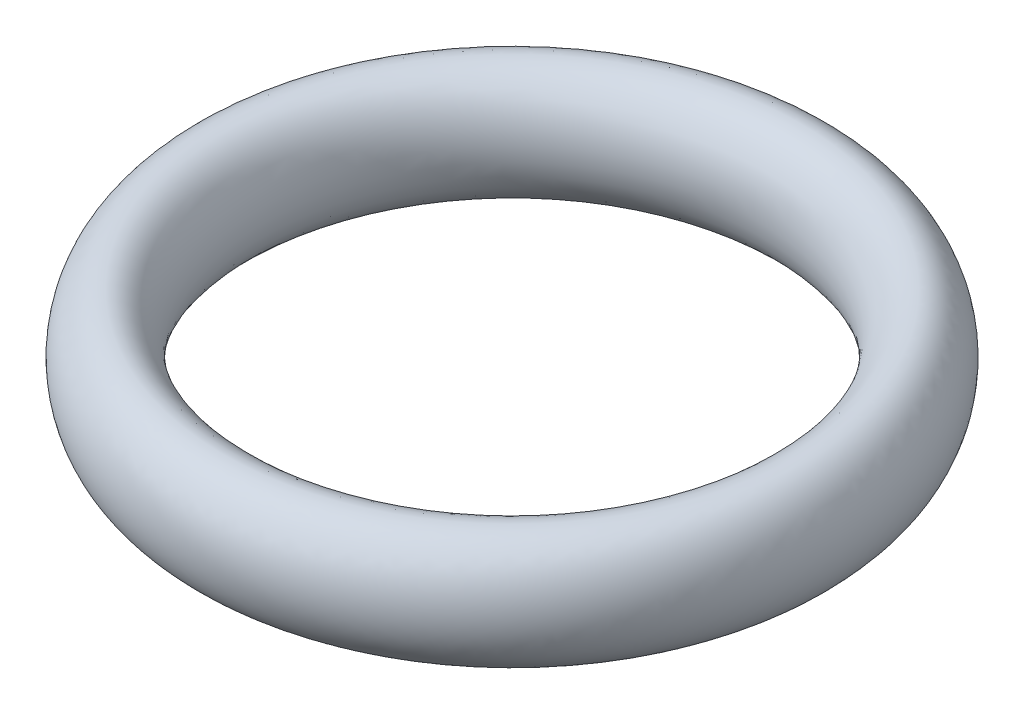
from build123d import *

# Parameters (mm, degrees)
SKETCH1_RX = 0.889
SKETCH1_RY = 0.635


with BuildPart() as part:
    # Sketch1 → Body (revolve)
    with BuildSketch(Plane.XY):
        with Locations(Location((4.3561, 0.889), (0, 0, 90))):
            Ellipse(SKETCH1_RX, SKETCH1_RY)
    revolve(axis=Axis((0, 0, 0), (0, 1, 0)))


solid = part.part
